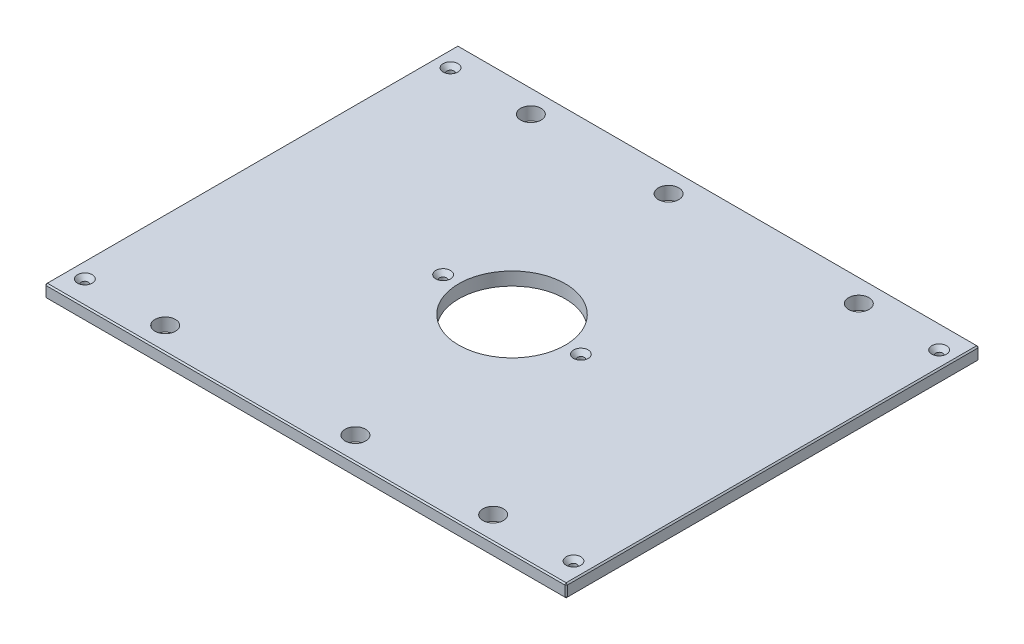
from build123d import *

# Parameters (mm, degrees)
SKETCH1_W                                        = 504.825
SKETCH1_H                                        = 400.05
BOSS_EXTRUDE1_DEPTH                              = 12.7
SKETCH13_R                                       = 51.562
CUT_EXTRUDE6_DEPTH                               = 323.309417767
F_25_32_0_78125_DIAMETER_HOLE1_D                 = 19.84375
CHAMFER2_SIZE                                    = 1.27
CSK_FOR_1_4_FLAT_HEAD_MACHINE_SCREW1_D           = 6.7564
CSK_FOR_1_4_FLAT_HEAD_MACHINE_SCREW1_CSINK_D     = 14.2748
CSK_FOR_1_4_FLAT_HEAD_MACHINE_SCREW1_CSINK_ANGLE = 82


with BuildPart() as part:
    # Sketch1 → Boss-Extrude1 (new body)
    with BuildSketch(Plane(origin=(0, 0, 0), x_dir=(1, 0, 0), z_dir=(0, 1, 0))):
        Rectangle(SKETCH1_W, SKETCH1_H)
    extrude(amount=BOSS_EXTRUDE1_DEPTH)

    # Sketch13 → Cut-Extrude6 (cut, through all)
    with BuildSketch(Plane(origin=(0, 12.7, 0), x_dir=(1, 0, 0), z_dir=(0, 1, 0))):
        with Locations(Location((0, 0, 0), (0, 0, 270))):
            Circle(SKETCH13_R)
    extrude(amount=-CUT_EXTRUDE6_DEPTH, mode=Mode.SUBTRACT)

    # 25_32 _0.78125_ Diameter Hole1 (through all)
    with Locations(Plane(origin=(0, 12.7, 0), x_dir=(1, 0, 0), z_dir=(0, 1, 0))):
        with Locations((158.75, 177.00498), (-158.75, 177.00498), (158.75, -177.00498), (-158.75, -177.00498), (-25.4, 177.00498), (25.4, -177.00498)):
            Hole(F_25_32_0_78125_DIAMETER_HOLE1_D / 2)

    # Chamfer2
    chamfer2_edges = [part.edges().sort_by_distance(p)[0] for p in [
        (252.4125, 12.7, 0),
        (0, 12.7, -200.025),
        (-252.4125, 12.7, 0),
        (0, 0, -200.025),
        (252.4125, 0, 0),
        (0, 0, 200.025),
        (-252.4125, 0, 0),
        (0, 12.7, 200.025),
        (-252.4125, 6.35, -200.025),
        (252.4125, 6.35, -200.025),
        (252.4125, 6.35, 200.025),
        (-252.4125, 6.35, 200.025),
    ]]
    chamfer(chamfer2_edges, length=CHAMFER2_SIZE)

    # CSK for 1_4 Flat Head Machine Screw1 (through all)
    with Locations(Plane(origin=(0, 12.7, 0), x_dir=(1, 0, 0), z_dir=(0, 1, 0))):
        with Locations((236.5375, 177.00498), (236.5375, -177.00498), (-236.5375, -177.00498), (-66.675, 0), (66.675, 0), (-236.5375, 177.00498), (-158.75, 177.00498), (-158.75, -177.00498)):
            CounterSinkHole(CSK_FOR_1_4_FLAT_HEAD_MACHINE_SCREW1_D / 2, CSK_FOR_1_4_FLAT_HEAD_MACHINE_SCREW1_CSINK_D / 2, counter_sink_angle=CSK_FOR_1_4_FLAT_HEAD_MACHINE_SCREW1_CSINK_ANGLE)


solid = part.part
